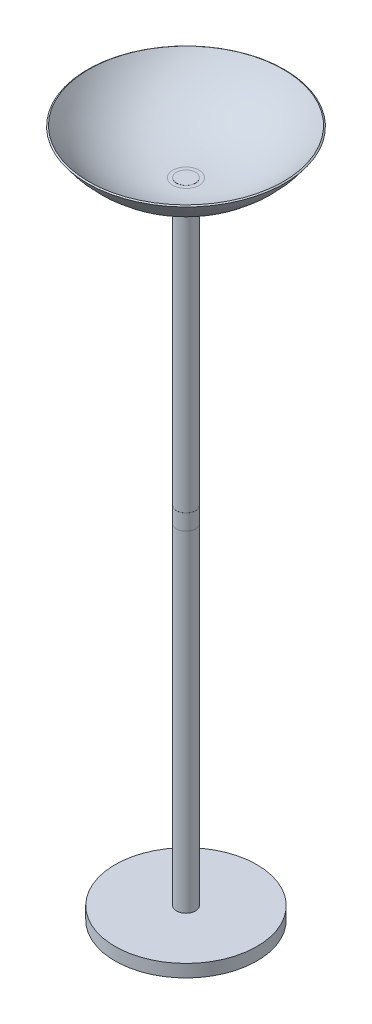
from build123d import *

# Parameters (mm, degrees)
SKETCH1_R           = 6
BASE_EXTRUDE_DEPTH  = 180
SKETCH2_R           = 6.05
BOSS_EXTRUDE1_DEPTH = 10
BOSS_EXTRUDE2_START = 210
SKETCH3_R           = 6
BOSS_EXTRUDE2_DEPTH = 210
SKETCH4_R           = 45
BOSS_EXTRUDE3_DEPTH = 8
SCALE1_SCALE        = 4


with BuildPart() as part:
    # Sketch1 → Base-Extrude (new body)
    with BuildSketch(Plane(origin=(0, 0, 0), x_dir=(1, 0, 0), z_dir=(0, 1, 0))):
        with Locations(Location((0, 0, 0), (0, 0, 90))):
            Circle(SKETCH1_R)
    extrude(amount=BASE_EXTRUDE_DEPTH)

    # Sketch2 → Boss-Extrude1 (add)
    with BuildSketch(Plane.XZ):
        with Locations(Location((0, 0, 0), (0, 0, 270))):
            Circle(SKETCH2_R)
    extrude(amount=BOSS_EXTRUDE1_DEPTH)

    # Sketch3 → Boss-Extrude2 (add)
    with BuildSketch(Plane.XZ.offset(10).offset(BOSS_EXTRUDE2_START)):
        with Locations(Location((0, 0, 0), (0, 0, 270))):
            Circle(SKETCH3_R)
    extrude(amount=-BOSS_EXTRUDE2_DEPTH)

    # Sketch4 → Boss-Extrude3 (add)
    with BuildSketch(Plane.XZ.offset(220)):
        with Locations(Location((0, 0, 0), (0, 0, 270))):
            Circle(SKETCH4_R)
    extrude(amount=BOSS_EXTRUDE3_DEPTH)

    # Sketch5 → Boss-Revolve-Thin1 (revolve)
    with BuildSketch(Plane.XY, mode=Mode.PRIVATE) as boss_revolve_thin1_sk:
        with BuildLine():
            Line((0, 179.958378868), (8.34246908, 179.958378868))
            ThreePointArc((8.34246908, 179.958378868), (38.657452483, 187.592823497), (61.740544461, 208.674897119))
            Line((61.740544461, 208.674897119), (62.574826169, 208.123558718))
            ThreePointArc((62.574826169, 208.123558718), (39.131088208, 186.712102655), (8.34246908, 178.958378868))
            Line((8.34246908, 178.958378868), (0, 178.958378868))
            Line((0, 178.958378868), (0, 179.958378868))
        make_face()
    revolve(boss_revolve_thin1_sk.sketch.rotate(Axis((0, 208.674897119, 0), (0, -1, 0)), 90), axis=Axis((0, 208.674897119, 0), (0, -1, 0)))


with BuildPart() as part_1:
    # Scale1: scaled about (0, -84.253032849, 0)
    add(part.part.scale(SCALE1_SCALE).moved(Location((0, 252.759098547, 0))))


solid = part_1.part
